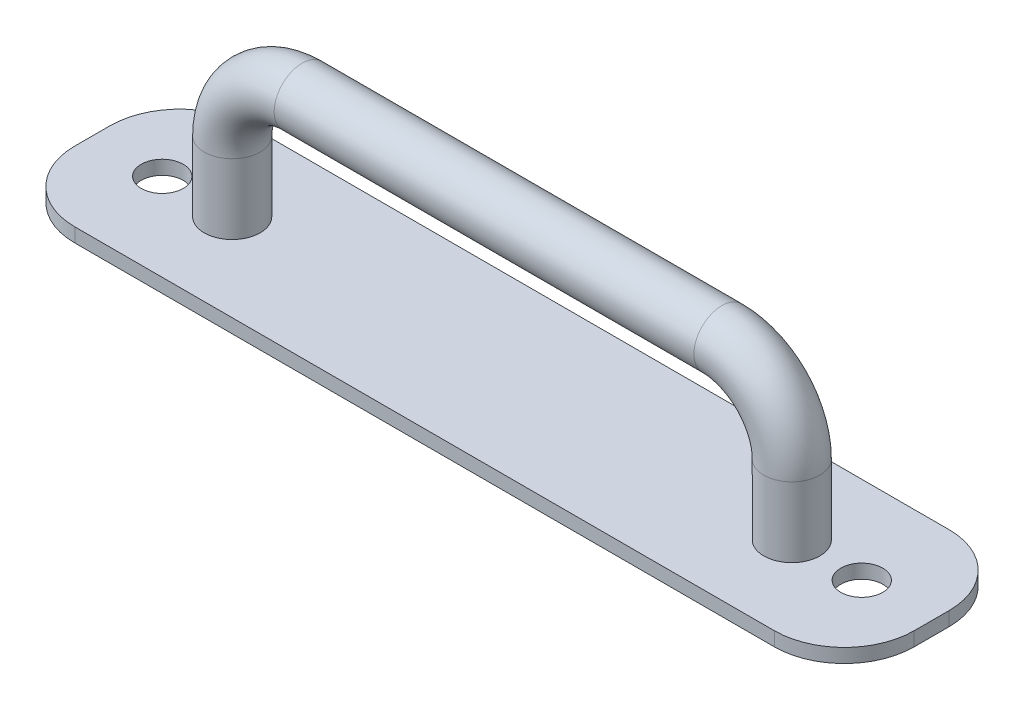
ISO-10303-21;
HEADER;
FILE_DESCRIPTION(('STEP AP214'),'2;1');
FILE_NAME('part.step','',(''),(''),'','','');
FILE_SCHEMA(('AUTOMOTIVE_DESIGN { 1 0 10303 214 1 1 1 1 }'));
ENDSEC;
DATA;
#1=APPLICATION_CONTEXT('core data for automotive mechanical design processes');
#2=APPLICATION_PROTOCOL_DEFINITION('international standard','automotive_design',2000,#1);
#3=PRODUCT_CONTEXT('',#1,'mechanical');
#4=PRODUCT('Part','Part','',(#3));
#5=PRODUCT_RELATED_PRODUCT_CATEGORY('part','',(#4));
#6=PRODUCT_DEFINITION_FORMATION('','',#4);
#7=PRODUCT_DEFINITION_CONTEXT('part definition',#1,'design');
#8=PRODUCT_DEFINITION('design','',#6,#7);
#9=PRODUCT_DEFINITION_SHAPE('','',#8);
#10=(LENGTH_UNIT() NAMED_UNIT(*) SI_UNIT(.MILLI.,.METRE.));
#11=(NAMED_UNIT(*) PLANE_ANGLE_UNIT() SI_UNIT($,.RADIAN.));
#12=(NAMED_UNIT(*) SI_UNIT($,.STERADIAN.) SOLID_ANGLE_UNIT());
#13=UNCERTAINTY_MEASURE_WITH_UNIT(LENGTH_MEASURE(1.E-05),#10,'distance_accuracy_value','');
#14=(GEOMETRIC_REPRESENTATION_CONTEXT(3) GLOBAL_UNCERTAINTY_ASSIGNED_CONTEXT((#13)) GLOBAL_UNIT_ASSIGNED_CONTEXT((#10,
#11,#12)) REPRESENTATION_CONTEXT('',''));
#15=CARTESIAN_POINT('',(0.,0.,0.));
#16=DIRECTION('',(0.,0.,1.));
#17=DIRECTION('',(1.,0.,0.));
#18=AXIS2_PLACEMENT_3D('',#15,#16,#17);
#19=CARTESIAN_POINT('',(0.,2.,0.));
#20=DIRECTION('',(0.,-1.,0.));
#21=DIRECTION('',(0.,0.,-1.));
#22=AXIS2_PLACEMENT_3D('',#19,#20,#21);
#23=PLANE('',#22);
#24=CARTESIAN_POINT('',(-50.,2.,0.));
#25=DIRECTION('',(0.,1.,0.));
#26=DIRECTION('',(0.,0.,1.));
#27=AXIS2_PLACEMENT_3D('',#24,#25,#26);
#28=CIRCLE('',#27,2.99999999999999);
#29=CARTESIAN_POINT('',(-50.,2.,2.99999999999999));
#30=VERTEX_POINT('',#29);
#31=EDGE_CURVE('E197',#30,#30,#28,.T.);
#32=ORIENTED_EDGE('',*,*,#31,.F.);
#33=EDGE_LOOP('',(#32));
#34=FACE_BOUND('',#33,.T.);
#35=CARTESIAN_POINT('',(50.,2.,0.));
#36=DIRECTION('',(0.,1.,0.));
#37=DIRECTION('',(0.,0.,1.));
#38=AXIS2_PLACEMENT_3D('',#35,#36,#37);
#39=CIRCLE('',#38,2.99999999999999);
#40=CARTESIAN_POINT('',(50.,2.,2.99999999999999));
#41=VERTEX_POINT('',#40);
#42=EDGE_CURVE('E191',#41,#41,#39,.T.);
#43=ORIENTED_EDGE('',*,*,#42,.F.);
#44=EDGE_LOOP('',(#43));
#45=FACE_BOUND('',#44,.T.);
#46=CARTESIAN_POINT('',(-40.,2.,0.));
#47=DIRECTION('',(0.,1.,0.));
#48=DIRECTION('',(0.,0.,1.));
#49=AXIS2_PLACEMENT_3D('',#46,#47,#48);
#50=CIRCLE('',#49,4.00000000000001);
#51=CARTESIAN_POINT('',(-40.,2.,4.00000000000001));
#52=VERTEX_POINT('',#51);
#53=EDGE_CURVE('E133',#52,#52,#50,.T.);
#54=ORIENTED_EDGE('',*,*,#53,.F.);
#55=EDGE_LOOP('',(#54));
#56=FACE_BOUND('',#55,.T.);
#57=DIRECTION('',(-1.,0.,0.));
#58=VECTOR('',#57,1.);
#59=CARTESIAN_POINT('',(-60.,2.,-12.5));
#60=LINE('',#59,#58);
#61=CARTESIAN_POINT('',(50.,2.,-12.5));
#62=VERTEX_POINT('',#61);
#63=CARTESIAN_POINT('',(-50.,2.,-12.5));
#64=VERTEX_POINT('',#63);
#65=EDGE_CURVE('E171',#62,#64,#60,.T.);
#66=ORIENTED_EDGE('',*,*,#65,.T.);
#67=CARTESIAN_POINT('',(-50.,2.,-2.5));
#68=DIRECTION('',(0.,-1.,0.));
#69=DIRECTION('',(0.,0.,-1.));
#70=AXIS2_PLACEMENT_3D('',#67,#68,#69);
#71=CIRCLE('',#70,10.);
#72=CARTESIAN_POINT('',(-60.,2.,-2.5));
#73=VERTEX_POINT('',#72);
#74=EDGE_CURVE('E147',#64,#73,#71,.F.);
#75=ORIENTED_EDGE('',*,*,#74,.T.);
#76=DIRECTION('',(0.,0.,1.));
#77=VECTOR('',#76,1.);
#78=CARTESIAN_POINT('',(-60.,2.,12.5));
#79=LINE('',#78,#77);
#80=CARTESIAN_POINT('',(-60.,2.,2.5));
#81=VERTEX_POINT('',#80);
#82=EDGE_CURVE('E118',#73,#81,#79,.T.);
#83=ORIENTED_EDGE('',*,*,#82,.T.);
#84=CARTESIAN_POINT('',(-50.,2.,2.5));
#85=DIRECTION('',(0.,-1.,0.));
#86=DIRECTION('',(0.,0.,-1.));
#87=AXIS2_PLACEMENT_3D('',#84,#85,#86);
#88=CIRCLE('',#87,10.);
#89=CARTESIAN_POINT('',(-50.,2.,12.5));
#90=VERTEX_POINT('',#89);
#91=EDGE_CURVE('E55',#81,#90,#88,.F.);
#92=ORIENTED_EDGE('',*,*,#91,.T.);
#93=DIRECTION('',(1.,0.,0.));
#94=VECTOR('',#93,1.);
#95=CARTESIAN_POINT('',(-60.,2.,12.5));
#96=LINE('',#95,#94);
#97=CARTESIAN_POINT('',(50.,2.,12.5));
#98=VERTEX_POINT('',#97);
#99=EDGE_CURVE('E168',#90,#98,#96,.T.);
#100=ORIENTED_EDGE('',*,*,#99,.T.);
#101=CARTESIAN_POINT('',(50.,2.,2.5));
#102=DIRECTION('',(0.,-1.,0.));
#103=DIRECTION('',(0.,0.,-1.));
#104=AXIS2_PLACEMENT_3D('',#101,#102,#103);
#105=CIRCLE('',#104,10.);
#106=CARTESIAN_POINT('',(60.,2.,2.5));
#107=VERTEX_POINT('',#106);
#108=EDGE_CURVE('E142',#98,#107,#105,.F.);
#109=ORIENTED_EDGE('',*,*,#108,.T.);
#110=DIRECTION('',(0.,0.,-1.));
#111=VECTOR('',#110,1.);
#112=CARTESIAN_POINT('',(60.,2.,12.5));
#113=LINE('',#112,#111);
#114=CARTESIAN_POINT('',(60.,2.,-2.5));
#115=VERTEX_POINT('',#114);
#116=EDGE_CURVE('E127',#107,#115,#113,.T.);
#117=ORIENTED_EDGE('',*,*,#116,.T.);
#118=CARTESIAN_POINT('',(50.,2.,-2.5));
#119=DIRECTION('',(0.,-1.,0.));
#120=DIRECTION('',(0.,0.,-1.));
#121=AXIS2_PLACEMENT_3D('',#118,#119,#120);
#122=CIRCLE('',#121,10.);
#123=EDGE_CURVE('E144',#115,#62,#122,.F.);
#124=ORIENTED_EDGE('',*,*,#123,.T.);
#125=EDGE_LOOP('',(#66,#75,#83,#92,#100,#109,#117,#124));
#126=FACE_BOUND('',#125,.T.);
#127=CARTESIAN_POINT('',(40.,2.,0.));
#128=DIRECTION('',(0.,-1.,0.));
#129=DIRECTION('',(0.,0.,1.));
#130=AXIS2_PLACEMENT_3D('',#127,#128,#129);
#131=CIRCLE('',#130,4.00000000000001);
#132=CARTESIAN_POINT('',(40.,2.,4.00000000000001));
#133=VERTEX_POINT('',#132);
#134=EDGE_CURVE('E163',#133,#133,#131,.T.);
#135=ORIENTED_EDGE('',*,*,#134,.T.);
#136=EDGE_LOOP('',(#135));
#137=FACE_BOUND('',#136,.T.);
#138=ADVANCED_FACE('F33',(#34,#45,#56,#126,#137),#23,.F.);
#139=CARTESIAN_POINT('',(60.,2.,12.5));
#140=DIRECTION('',(-1.,0.,0.));
#141=DIRECTION('',(0.,0.,1.));
#142=AXIS2_PLACEMENT_3D('',#139,#140,#141);
#143=PLANE('',#142);
#144=DIRECTION('',(0.,0.,-1.));
#145=VECTOR('',#144,1.);
#146=CARTESIAN_POINT('',(60.,0.,12.5));
#147=LINE('',#146,#145);
#148=CARTESIAN_POINT('',(60.,0.,2.5));
#149=VERTEX_POINT('',#148);
#150=CARTESIAN_POINT('',(60.,0.,-2.5));
#151=VERTEX_POINT('',#150);
#152=EDGE_CURVE('E129',#149,#151,#147,.T.);
#153=ORIENTED_EDGE('',*,*,#152,.T.);
#154=DIRECTION('',(0.,-1.,0.));
#155=VECTOR('',#154,1.);
#156=CARTESIAN_POINT('',(60.,2.,-2.5));
#157=LINE('',#156,#155);
#158=EDGE_CURVE('E11',#151,#115,#157,.F.);
#159=ORIENTED_EDGE('',*,*,#158,.T.);
#160=ORIENTED_EDGE('',*,*,#116,.F.);
#161=DIRECTION('',(0.,-1.,0.));
#162=VECTOR('',#161,1.);
#163=CARTESIAN_POINT('',(60.,2.,2.5));
#164=LINE('',#163,#162);
#165=EDGE_CURVE('E41',#107,#149,#164,.T.);
#166=ORIENTED_EDGE('',*,*,#165,.T.);
#167=EDGE_LOOP('',(#153,#159,#160,#166));
#168=FACE_BOUND('',#167,.T.);
#169=ADVANCED_FACE('F158',(#168),#143,.F.);
#170=CARTESIAN_POINT('',(-60.,2.,-12.5));
#171=DIRECTION('',(0.,0.,1.));
#172=DIRECTION('',(1.,0.,0.));
#173=AXIS2_PLACEMENT_3D('',#170,#171,#172);
#174=PLANE('',#173);
#175=DIRECTION('',(-1.,0.,0.));
#176=VECTOR('',#175,1.);
#177=CARTESIAN_POINT('',(-60.,0.,-12.5));
#178=LINE('',#177,#176);
#179=CARTESIAN_POINT('',(50.,0.,-12.5));
#180=VERTEX_POINT('',#179);
#181=CARTESIAN_POINT('',(-50.,0.,-12.5));
#182=VERTEX_POINT('',#181);
#183=EDGE_CURVE('E125',#180,#182,#178,.T.);
#184=ORIENTED_EDGE('',*,*,#183,.T.);
#185=DIRECTION('',(0.,-1.,0.));
#186=VECTOR('',#185,1.);
#187=CARTESIAN_POINT('',(-50.,2.,-12.5));
#188=LINE('',#187,#186);
#189=EDGE_CURVE('E104',#182,#64,#188,.F.);
#190=ORIENTED_EDGE('',*,*,#189,.T.);
#191=ORIENTED_EDGE('',*,*,#65,.F.);
#192=DIRECTION('',(0.,-1.,0.));
#193=VECTOR('',#192,1.);
#194=CARTESIAN_POINT('',(50.,2.,-12.5));
#195=LINE('',#194,#193);
#196=EDGE_CURVE('E109',#62,#180,#195,.T.);
#197=ORIENTED_EDGE('',*,*,#196,.T.);
#198=EDGE_LOOP('',(#184,#190,#191,#197));
#199=FACE_BOUND('',#198,.T.);
#200=ADVANCED_FACE('F280',(#199),#174,.F.);
#201=CARTESIAN_POINT('',(-60.,2.,12.5));
#202=DIRECTION('',(1.,0.,0.));
#203=DIRECTION('',(0.,0.,-1.));
#204=AXIS2_PLACEMENT_3D('',#201,#202,#203);
#205=PLANE('',#204);
#206=ORIENTED_EDGE('',*,*,#82,.F.);
#207=DIRECTION('',(0.,-1.,0.));
#208=VECTOR('',#207,1.);
#209=CARTESIAN_POINT('',(-60.,2.,-2.5));
#210=LINE('',#209,#208);
#211=CARTESIAN_POINT('',(-60.,0.,-2.5));
#212=VERTEX_POINT('',#211);
#213=EDGE_CURVE('E103',#73,#212,#210,.T.);
#214=ORIENTED_EDGE('',*,*,#213,.T.);
#215=DIRECTION('',(0.,0.,1.));
#216=VECTOR('',#215,1.);
#217=CARTESIAN_POINT('',(-60.,0.,12.5));
#218=LINE('',#217,#216);
#219=CARTESIAN_POINT('',(-60.,0.,2.5));
#220=VERTEX_POINT('',#219);
#221=EDGE_CURVE('E116',#212,#220,#218,.T.);
#222=ORIENTED_EDGE('',*,*,#221,.T.);
#223=DIRECTION('',(0.,-1.,0.));
#224=VECTOR('',#223,1.);
#225=CARTESIAN_POINT('',(-60.,2.,2.5));
#226=LINE('',#225,#224);
#227=EDGE_CURVE('E120',#220,#81,#226,.F.);
#228=ORIENTED_EDGE('',*,*,#227,.T.);
#229=EDGE_LOOP('',(#206,#214,#222,#228));
#230=FACE_BOUND('',#229,.T.);
#231=ADVANCED_FACE('F115',(#230),#205,.F.);
#232=CARTESIAN_POINT('',(-60.,2.,12.5));
#233=DIRECTION('',(0.,0.,-1.));
#234=DIRECTION('',(-1.,0.,0.));
#235=AXIS2_PLACEMENT_3D('',#232,#233,#234);
#236=PLANE('',#235);
#237=ORIENTED_EDGE('',*,*,#99,.F.);
#238=DIRECTION('',(0.,-1.,0.));
#239=VECTOR('',#238,1.);
#240=CARTESIAN_POINT('',(-50.,2.,12.5));
#241=LINE('',#240,#239);
#242=CARTESIAN_POINT('',(-50.,0.,12.5));
#243=VERTEX_POINT('',#242);
#244=EDGE_CURVE('E150',#90,#243,#241,.T.);
#245=ORIENTED_EDGE('',*,*,#244,.T.);
#246=DIRECTION('',(1.,0.,0.));
#247=VECTOR('',#246,1.);
#248=CARTESIAN_POINT('',(-60.,0.,12.5));
#249=LINE('',#248,#247);
#250=CARTESIAN_POINT('',(50.,0.,12.5));
#251=VERTEX_POINT('',#250);
#252=EDGE_CURVE('E124',#243,#251,#249,.T.);
#253=ORIENTED_EDGE('',*,*,#252,.T.);
#254=DIRECTION('',(0.,-1.,0.));
#255=VECTOR('',#254,1.);
#256=CARTESIAN_POINT('',(50.,2.,12.5));
#257=LINE('',#256,#255);
#258=EDGE_CURVE('E48',#251,#98,#257,.F.);
#259=ORIENTED_EDGE('',*,*,#258,.T.);
#260=EDGE_LOOP('',(#237,#245,#253,#259));
#261=FACE_BOUND('',#260,.T.);
#262=ADVANCED_FACE('F246',(#261),#236,.F.);
#263=CARTESIAN_POINT('',(0.,0.,0.));
#264=DIRECTION('',(0.,-1.,0.));
#265=DIRECTION('',(0.,0.,-1.));
#266=AXIS2_PLACEMENT_3D('',#263,#264,#265);
#267=PLANE('',#266);
#268=CARTESIAN_POINT('',(-50.,0.,0.));
#269=DIRECTION('',(0.,-1.,0.));
#270=DIRECTION('',(0.,0.,-1.));
#271=AXIS2_PLACEMENT_3D('',#268,#269,#270);
#272=CIRCLE('',#271,3.);
#273=CARTESIAN_POINT('',(-50.,0.,-3.));
#274=VERTEX_POINT('',#273);
#275=EDGE_CURVE('E194',#274,#274,#272,.T.);
#276=ORIENTED_EDGE('',*,*,#275,.F.);
#277=EDGE_LOOP('',(#276));
#278=FACE_BOUND('',#277,.T.);
#279=CARTESIAN_POINT('',(50.,0.,0.));
#280=DIRECTION('',(0.,-1.,0.));
#281=DIRECTION('',(0.,0.,-1.));
#282=AXIS2_PLACEMENT_3D('',#279,#280,#281);
#283=CIRCLE('',#282,3.);
#284=CARTESIAN_POINT('',(50.,0.,-3.));
#285=VERTEX_POINT('',#284);
#286=EDGE_CURVE('E186',#285,#285,#283,.T.);
#287=ORIENTED_EDGE('',*,*,#286,.F.);
#288=EDGE_LOOP('',(#287));
#289=FACE_BOUND('',#288,.T.);
#290=ORIENTED_EDGE('',*,*,#221,.F.);
#291=CARTESIAN_POINT('',(-50.,0.,-2.5));
#292=DIRECTION('',(0.,-1.,0.));
#293=DIRECTION('',(0.,0.,-1.));
#294=AXIS2_PLACEMENT_3D('',#291,#292,#293);
#295=CIRCLE('',#294,10.);
#296=EDGE_CURVE('E99',#212,#182,#295,.T.);
#297=ORIENTED_EDGE('',*,*,#296,.T.);
#298=ORIENTED_EDGE('',*,*,#183,.F.);
#299=CARTESIAN_POINT('',(50.,0.,-2.5));
#300=DIRECTION('',(0.,-1.,0.));
#301=DIRECTION('',(0.,0.,-1.));
#302=AXIS2_PLACEMENT_3D('',#299,#300,#301);
#303=CIRCLE('',#302,10.);
#304=EDGE_CURVE('E136',#180,#151,#303,.T.);
#305=ORIENTED_EDGE('',*,*,#304,.T.);
#306=ORIENTED_EDGE('',*,*,#152,.F.);
#307=CARTESIAN_POINT('',(50.,0.,2.5));
#308=DIRECTION('',(0.,-1.,0.));
#309=DIRECTION('',(0.,0.,-1.));
#310=AXIS2_PLACEMENT_3D('',#307,#308,#309);
#311=CIRCLE('',#310,10.);
#312=EDGE_CURVE('E119',#149,#251,#311,.T.);
#313=ORIENTED_EDGE('',*,*,#312,.T.);
#314=ORIENTED_EDGE('',*,*,#252,.F.);
#315=CARTESIAN_POINT('',(-50.,0.,2.5));
#316=DIRECTION('',(0.,-1.,0.));
#317=DIRECTION('',(0.,0.,-1.));
#318=AXIS2_PLACEMENT_3D('',#315,#316,#317);
#319=CIRCLE('',#318,10.);
#320=EDGE_CURVE('E110',#243,#220,#319,.T.);
#321=ORIENTED_EDGE('',*,*,#320,.T.);
#322=EDGE_LOOP('',(#290,#297,#298,#305,#306,#313,#314,#321));
#323=FACE_BOUND('',#322,.T.);
#324=ADVANCED_FACE('F122',(#278,#289,#323),#267,.T.);
#325=CARTESIAN_POINT('',(-40.,2.,0.));
#326=DIRECTION('',(0.,1.,0.));
#327=DIRECTION('',(0.,0.,1.));
#328=AXIS2_PLACEMENT_3D('',#325,#326,#327);
#329=CYLINDRICAL_SURFACE('',#328,4.00000000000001);
#330=CARTESIAN_POINT('',(-40.,12.,0.));
#331=DIRECTION('',(0.,1.,0.));
#332=DIRECTION('',(0.,0.,1.));
#333=AXIS2_PLACEMENT_3D('',#330,#331,#332);
#334=CIRCLE('',#333,4.00000000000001);
#335=CARTESIAN_POINT('',(-44.,12.,0.));
#336=VERTEX_POINT('',#335);
#337=EDGE_CURVE('E183',#336,#336,#334,.T.);
#338=ORIENTED_EDGE('',*,*,#337,.F.);
#339=EDGE_LOOP('',(#338));
#340=FACE_BOUND('',#339,.T.);
#341=ORIENTED_EDGE('',*,*,#53,.T.);
#342=EDGE_LOOP('',(#341));
#343=FACE_BOUND('',#342,.T.);
#344=ADVANCED_FACE('F236',(#340,#343),#329,.T.);
#345=CARTESIAN_POINT('',(-30.,12.,0.));
#346=DIRECTION('',(0.,0.,-1.));
#347=DIRECTION('',(-1.,0.,0.));
#348=AXIS2_PLACEMENT_3D('',#345,#346,#347);
#349=TOROIDAL_SURFACE('',#348,10.,4.00000000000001);
#350=CARTESIAN_POINT('',(-30.,22.,0.));
#351=DIRECTION('',(1.,0.,0.));
#352=DIRECTION('',(0.,0.,1.));
#353=AXIS2_PLACEMENT_3D('',#350,#351,#352);
#354=CIRCLE('',#353,4.00000000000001);
#355=CARTESIAN_POINT('',(-30.,26.,0.));
#356=VERTEX_POINT('',#355);
#357=EDGE_CURVE('E180',#356,#356,#354,.T.);
#358=CARTESIAN_POINT('',(-30.,12.,0.));
#359=DIRECTION('',(0.,0.,-1.));
#360=DIRECTION('',(-1.,0.,0.));
#361=AXIS2_PLACEMENT_3D('',#358,#359,#360);
#362=CIRCLE('',#361,14.);
#363=EDGE_CURVE('',#336,#356,#362,.T.);
#364=ORIENTED_EDGE('',*,*,#337,.T.);
#365=ORIENTED_EDGE('',*,*,#357,.F.);
#366=ORIENTED_EDGE('',*,*,#363,.T.);
#367=ORIENTED_EDGE('',*,*,#363,.F.);
#368=EDGE_LOOP('',(#364,#366,#365,#367));
#369=FACE_BOUND('',#368,.T.);
#370=ADVANCED_FACE('F230',(#369),#349,.T.);
#371=CARTESIAN_POINT('',(-30.,22.,0.));
#372=DIRECTION('',(1.,0.,0.));
#373=DIRECTION('',(0.,0.,-1.));
#374=AXIS2_PLACEMENT_3D('',#371,#372,#373);
#375=CYLINDRICAL_SURFACE('',#374,4.00000000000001);
#376=CARTESIAN_POINT('',(30.,22.,0.));
#377=DIRECTION('',(1.,0.,0.));
#378=DIRECTION('',(0.,0.,1.));
#379=AXIS2_PLACEMENT_3D('',#376,#377,#378);
#380=CIRCLE('',#379,4.00000000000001);
#381=CARTESIAN_POINT('',(30.,26.,0.));
#382=VERTEX_POINT('',#381);
#383=EDGE_CURVE('E177',#382,#382,#380,.T.);
#384=ORIENTED_EDGE('',*,*,#383,.F.);
#385=EDGE_LOOP('',(#384));
#386=FACE_BOUND('',#385,.T.);
#387=ORIENTED_EDGE('',*,*,#357,.T.);
#388=EDGE_LOOP('',(#387));
#389=FACE_BOUND('',#388,.T.);
#390=ADVANCED_FACE('F224',(#386,#389),#375,.T.);
#391=CARTESIAN_POINT('',(30.,12.,0.));
#392=DIRECTION('',(0.,0.,-1.));
#393=DIRECTION('',(-1.,0.,0.));
#394=AXIS2_PLACEMENT_3D('',#391,#392,#393);
#395=TOROIDAL_SURFACE('',#394,10.,4.00000000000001);
#396=CARTESIAN_POINT('',(40.,12.,0.));
#397=DIRECTION('',(0.,-1.,0.));
#398=DIRECTION('',(0.,0.,1.));
#399=AXIS2_PLACEMENT_3D('',#396,#397,#398);
#400=CIRCLE('',#399,4.00000000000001);
#401=CARTESIAN_POINT('',(44.,12.,0.));
#402=VERTEX_POINT('',#401);
#403=EDGE_CURVE('E165',#402,#402,#400,.T.);
#404=CARTESIAN_POINT('',(30.,12.,0.));
#405=DIRECTION('',(0.,0.,-1.));
#406=DIRECTION('',(-1.,0.,0.));
#407=AXIS2_PLACEMENT_3D('',#404,#405,#406);
#408=CIRCLE('',#407,14.);
#409=EDGE_CURVE('',#382,#402,#408,.T.);
#410=ORIENTED_EDGE('',*,*,#383,.T.);
#411=ORIENTED_EDGE('',*,*,#403,.F.);
#412=ORIENTED_EDGE('',*,*,#409,.T.);
#413=ORIENTED_EDGE('',*,*,#409,.F.);
#414=EDGE_LOOP('',(#410,#412,#411,#413));
#415=FACE_BOUND('',#414,.T.);
#416=ADVANCED_FACE('F218',(#415),#395,.T.);
#417=CARTESIAN_POINT('',(40.,12.,0.));
#418=DIRECTION('',(0.,-1.,0.));
#419=DIRECTION('',(0.,0.,-1.));
#420=AXIS2_PLACEMENT_3D('',#417,#418,#419);
#421=CYLINDRICAL_SURFACE('',#420,4.00000000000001);
#422=ORIENTED_EDGE('',*,*,#134,.F.);
#423=EDGE_LOOP('',(#422));
#424=FACE_BOUND('',#423,.T.);
#425=ORIENTED_EDGE('',*,*,#403,.T.);
#426=EDGE_LOOP('',(#425));
#427=FACE_BOUND('',#426,.T.);
#428=ADVANCED_FACE('F214',(#424,#427),#421,.T.);
#429=CARTESIAN_POINT('',(50.,2.,0.));
#430=DIRECTION('',(0.,1.,0.));
#431=DIRECTION('',(0.,0.,1.));
#432=AXIS2_PLACEMENT_3D('',#429,#430,#431);
#433=CYLINDRICAL_SURFACE('',#432,3.);
#434=ORIENTED_EDGE('',*,*,#42,.T.);
#435=EDGE_LOOP('',(#434));
#436=FACE_BOUND('',#435,.T.);
#437=ORIENTED_EDGE('',*,*,#286,.T.);
#438=EDGE_LOOP('',(#437));
#439=FACE_BOUND('',#438,.T.);
#440=ADVANCED_FACE('F217',(#436,#439),#433,.F.);
#441=CARTESIAN_POINT('',(-50.,2.,0.));
#442=DIRECTION('',(0.,1.,0.));
#443=DIRECTION('',(0.,0.,1.));
#444=AXIS2_PLACEMENT_3D('',#441,#442,#443);
#445=CYLINDRICAL_SURFACE('',#444,3.);
#446=ORIENTED_EDGE('',*,*,#31,.T.);
#447=EDGE_LOOP('',(#446));
#448=FACE_BOUND('',#447,.T.);
#449=ORIENTED_EDGE('',*,*,#275,.T.);
#450=EDGE_LOOP('',(#449));
#451=FACE_BOUND('',#450,.T.);
#452=ADVANCED_FACE('F201',(#448,#451),#445,.F.);
#453=CARTESIAN_POINT('',(-50.,2.,-2.5));
#454=DIRECTION('',(0.,-1.,0.));
#455=DIRECTION('',(0.,0.,-1.));
#456=AXIS2_PLACEMENT_3D('',#453,#454,#455);
#457=CYLINDRICAL_SURFACE('',#456,10.);
#458=ORIENTED_EDGE('',*,*,#74,.F.);
#459=ORIENTED_EDGE('',*,*,#189,.F.);
#460=ORIENTED_EDGE('',*,*,#296,.F.);
#461=ORIENTED_EDGE('',*,*,#213,.F.);
#462=EDGE_LOOP('',(#458,#459,#460,#461));
#463=FACE_BOUND('',#462,.T.);
#464=ADVANCED_FACE('F102',(#463),#457,.T.);
#465=CARTESIAN_POINT('',(-50.,2.,2.5));
#466=DIRECTION('',(0.,-1.,0.));
#467=DIRECTION('',(0.,0.,-1.));
#468=AXIS2_PLACEMENT_3D('',#465,#466,#467);
#469=CYLINDRICAL_SURFACE('',#468,10.);
#470=ORIENTED_EDGE('',*,*,#91,.F.);
#471=ORIENTED_EDGE('',*,*,#227,.F.);
#472=ORIENTED_EDGE('',*,*,#320,.F.);
#473=ORIENTED_EDGE('',*,*,#244,.F.);
#474=EDGE_LOOP('',(#470,#471,#472,#473));
#475=FACE_BOUND('',#474,.T.);
#476=ADVANCED_FACE('F262',(#475),#469,.T.);
#477=CARTESIAN_POINT('',(50.,2.,-2.5));
#478=DIRECTION('',(0.,-1.,0.));
#479=DIRECTION('',(0.,0.,-1.));
#480=AXIS2_PLACEMENT_3D('',#477,#478,#479);
#481=CYLINDRICAL_SURFACE('',#480,10.);
#482=ORIENTED_EDGE('',*,*,#123,.F.);
#483=ORIENTED_EDGE('',*,*,#158,.F.);
#484=ORIENTED_EDGE('',*,*,#304,.F.);
#485=ORIENTED_EDGE('',*,*,#196,.F.);
#486=EDGE_LOOP('',(#482,#483,#484,#485));
#487=FACE_BOUND('',#486,.T.);
#488=ADVANCED_FACE('F267',(#487),#481,.T.);
#489=CARTESIAN_POINT('',(50.,2.,2.5));
#490=DIRECTION('',(0.,-1.,0.));
#491=DIRECTION('',(0.,0.,-1.));
#492=AXIS2_PLACEMENT_3D('',#489,#490,#491);
#493=CYLINDRICAL_SURFACE('',#492,10.);
#494=ORIENTED_EDGE('',*,*,#108,.F.);
#495=ORIENTED_EDGE('',*,*,#258,.F.);
#496=ORIENTED_EDGE('',*,*,#312,.F.);
#497=ORIENTED_EDGE('',*,*,#165,.F.);
#498=EDGE_LOOP('',(#494,#495,#496,#497));
#499=FACE_BOUND('',#498,.T.);
#500=ADVANCED_FACE('F35',(#499),#493,.T.);
#501=CLOSED_SHELL('',(#138,#169,#200,#231,#262,#324,#344,#370,#390,#416,#428,#440,#452,#464,
#476,#488,#500));
#502=MANIFOLD_SOLID_BREP('B2',#501);
#503=ADVANCED_BREP_SHAPE_REPRESENTATION('',(#18,#502),#14);
#504=SHAPE_DEFINITION_REPRESENTATION(#9,#503);
ENDSEC;
END-ISO-10303-21;
